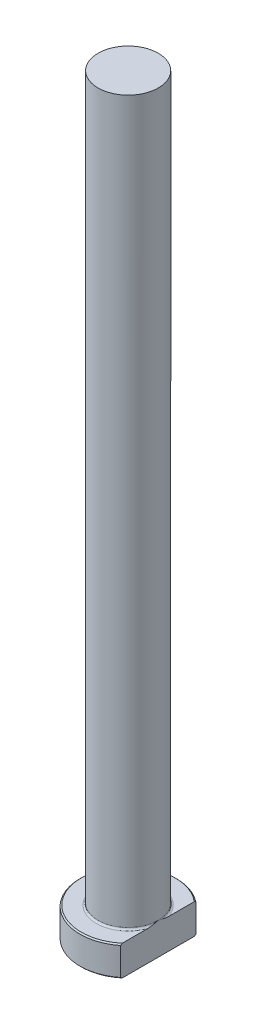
ISO-10303-21;
HEADER;
FILE_DESCRIPTION(('STEP AP214'),'2;1');
FILE_NAME('part.step','',(''),(''),'','','');
FILE_SCHEMA(('AUTOMOTIVE_DESIGN { 1 0 10303 214 1 1 1 1 }'));
ENDSEC;
DATA;
#1=APPLICATION_CONTEXT('core data for automotive mechanical design processes');
#2=APPLICATION_PROTOCOL_DEFINITION('international standard','automotive_design',2000,#1);
#3=PRODUCT_CONTEXT('',#1,'mechanical');
#4=PRODUCT('Part','Part','',(#3));
#5=PRODUCT_RELATED_PRODUCT_CATEGORY('part','',(#4));
#6=PRODUCT_DEFINITION_FORMATION('','',#4);
#7=PRODUCT_DEFINITION_CONTEXT('part definition',#1,'design');
#8=PRODUCT_DEFINITION('design','',#6,#7);
#9=PRODUCT_DEFINITION_SHAPE('','',#8);
#10=(LENGTH_UNIT() NAMED_UNIT(*) SI_UNIT(.MILLI.,.METRE.));
#11=(NAMED_UNIT(*) PLANE_ANGLE_UNIT() SI_UNIT($,.RADIAN.));
#12=(NAMED_UNIT(*) SI_UNIT($,.STERADIAN.) SOLID_ANGLE_UNIT());
#13=UNCERTAINTY_MEASURE_WITH_UNIT(LENGTH_MEASURE(1.E-05),#10,'distance_accuracy_value','');
#14=(GEOMETRIC_REPRESENTATION_CONTEXT(3) GLOBAL_UNCERTAINTY_ASSIGNED_CONTEXT((#13)) GLOBAL_UNIT_ASSIGNED_CONTEXT((#10,
#11,#12)) REPRESENTATION_CONTEXT('',''));
#15=CARTESIAN_POINT('',(0.,0.,0.));
#16=DIRECTION('',(0.,0.,1.));
#17=DIRECTION('',(1.,0.,0.));
#18=AXIS2_PLACEMENT_3D('',#15,#16,#17);
#19=CARTESIAN_POINT('',(0.,0.,0.));
#20=DIRECTION('',(0.,-1.,0.));
#21=DIRECTION('',(0.,0.,-1.));
#22=AXIS2_PLACEMENT_3D('',#19,#20,#21);
#23=PLANE('',#22);
#24=CARTESIAN_POINT('',(0.,0.,0.));
#25=DIRECTION('',(0.,-1.,0.));
#26=DIRECTION('',(0.,0.,-1.));
#27=AXIS2_PLACEMENT_3D('',#24,#25,#26);
#28=CIRCLE('',#27,7.80000000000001);
#29=CARTESIAN_POINT('',(4.99999999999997,0.,5.98665181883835));
#30=VERTEX_POINT('',#29);
#31=CARTESIAN_POINT('',(4.99999999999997,0.,-5.98665181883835));
#32=VERTEX_POINT('',#31);
#33=EDGE_CURVE('E98',#30,#32,#28,.T.);
#34=ORIENTED_EDGE('',*,*,#33,.T.);
#35=DIRECTION('',(0.,0.,1.));
#36=VECTOR('',#35,1.);
#37=CARTESIAN_POINT('',(4.99999999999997,0.,-6.24499799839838));
#38=LINE('',#37,#36);
#39=EDGE_CURVE('E83',#32,#30,#38,.T.);
#40=ORIENTED_EDGE('',*,*,#39,.T.);
#41=EDGE_LOOP('',(#34,#40));
#42=FACE_BOUND('',#41,.T.);
#43=ADVANCED_FACE('F32',(#42),#23,.T.);
#44=CARTESIAN_POINT('',(0.,259.958771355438,0.));
#45=DIRECTION('',(0.,1.,0.));
#46=DIRECTION('',(0.,0.,1.));
#47=AXIS2_PLACEMENT_3D('',#44,#45,#46);
#48=CYLINDRICAL_SURFACE('',#47,7.99999999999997);
#49=CARTESIAN_POINT('',(0.,4.79999999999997,0.));
#50=DIRECTION('',(0.,1.,0.));
#51=DIRECTION('',(0.,0.,1.));
#52=AXIS2_PLACEMENT_3D('',#49,#50,#51);
#53=CIRCLE('',#52,7.99999999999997);
#54=CARTESIAN_POINT('',(4.99999999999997,4.79999999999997,6.24499799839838));
#55=VERTEX_POINT('',#54);
#56=CARTESIAN_POINT('',(4.99999999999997,4.79999999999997,-6.24499799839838));
#57=VERTEX_POINT('',#56);
#58=EDGE_CURVE('E104',#55,#57,#53,.F.);
#59=ORIENTED_EDGE('',*,*,#58,.T.);
#60=DIRECTION('',(0.,-1.,0.));
#61=VECTOR('',#60,1.);
#62=CARTESIAN_POINT('',(4.99999999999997,125.,-6.24499799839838));
#63=LINE('',#62,#61);
#64=CARTESIAN_POINT('',(4.99999999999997,0.199999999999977,-6.24499799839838));
#65=VERTEX_POINT('',#64);
#66=EDGE_CURVE('E183',#57,#65,#63,.T.);
#67=ORIENTED_EDGE('',*,*,#66,.T.);
#68=CARTESIAN_POINT('',(0.,0.199999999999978,0.));
#69=DIRECTION('',(0.,-1.,0.));
#70=DIRECTION('',(0.,0.,-1.));
#71=AXIS2_PLACEMENT_3D('',#68,#69,#70);
#72=CIRCLE('',#71,7.99999999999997);
#73=CARTESIAN_POINT('',(4.99999999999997,0.199999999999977,6.24499799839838));
#74=VERTEX_POINT('',#73);
#75=EDGE_CURVE('E100',#65,#74,#72,.F.);
#76=ORIENTED_EDGE('',*,*,#75,.T.);
#77=DIRECTION('',(0.,-1.,0.));
#78=VECTOR('',#77,1.);
#79=CARTESIAN_POINT('',(4.99999999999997,125.,6.24499799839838));
#80=LINE('',#79,#78);
#81=EDGE_CURVE('E93',#55,#74,#80,.T.);
#82=ORIENTED_EDGE('',*,*,#81,.F.);
#83=EDGE_LOOP('',(#59,#67,#76,#82));
#84=FACE_BOUND('',#83,.T.);
#85=ADVANCED_FACE('F158',(#84),#48,.T.);
#86=CARTESIAN_POINT('',(-7.99999999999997,5.,0.));
#87=DIRECTION('',(0.,1.,0.));
#88=DIRECTION('',(0.,0.,1.));
#89=AXIS2_PLACEMENT_3D('',#86,#87,#88);
#90=PLANE('',#89);
#91=CARTESIAN_POINT('',(0.,5.,0.));
#92=DIRECTION('',(0.,1.,0.));
#93=DIRECTION('',(0.,0.,1.));
#94=AXIS2_PLACEMENT_3D('',#91,#92,#93);
#95=CIRCLE('',#94,7.79999999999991);
#96=CARTESIAN_POINT('',(4.99999999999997,5.,-5.98665181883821));
#97=VERTEX_POINT('',#96);
#98=CARTESIAN_POINT('',(4.99999999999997,5.,5.98665181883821));
#99=VERTEX_POINT('',#98);
#100=EDGE_CURVE('E178',#97,#99,#95,.T.);
#101=ORIENTED_EDGE('',*,*,#100,.T.);
#102=DIRECTION('',(0.,0.,-1.));
#103=VECTOR('',#102,1.);
#104=CARTESIAN_POINT('',(4.99999999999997,5.,0.));
#105=LINE('',#104,#103);
#106=CARTESIAN_POINT('',(4.99999999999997,4.99999999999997,1.75783958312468));
#107=VERTEX_POINT('',#106);
#108=EDGE_CURVE('E57',#99,#107,#105,.T.);
#109=ORIENTED_EDGE('',*,*,#108,.T.);
#110=CARTESIAN_POINT('',(0.,5.,0.));
#111=DIRECTION('',(0.,1.,0.));
#112=DIRECTION('',(0.,0.,1.));
#113=AXIS2_PLACEMENT_3D('',#110,#111,#112);
#114=CIRCLE('',#113,5.29999999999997);
#115=CARTESIAN_POINT('',(4.99999999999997,4.99999999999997,-1.75783958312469));
#116=VERTEX_POINT('',#115);
#117=EDGE_CURVE('E107',#107,#116,#114,.F.);
#118=ORIENTED_EDGE('',*,*,#117,.T.);
#119=EDGE_CURVE('E136',#116,#97,#105,.T.);
#120=ORIENTED_EDGE('',*,*,#119,.T.);
#121=EDGE_LOOP('',(#101,#109,#118,#120));
#122=FACE_BOUND('',#121,.T.);
#123=ADVANCED_FACE('F147',(#122),#90,.T.);
#124=CARTESIAN_POINT('',(0.,5.,0.));
#125=DIRECTION('',(0.,-1.,0.));
#126=DIRECTION('',(0.,0.,-1.));
#127=AXIS2_PLACEMENT_3D('',#124,#125,#126);
#128=CONICAL_SURFACE('',#127,7.7999999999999,0.785398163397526);
#129=ORIENTED_EDGE('',*,*,#58,.F.);
#130=CARTESIAN_POINT('',(4.99999999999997,-1.82162423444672,13.7401563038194));
#131=CARTESIAN_POINT('',(4.99999999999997,-1.61889813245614,13.5244204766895));
#132=CARTESIAN_POINT('',(4.99999999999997,-1.4164638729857,13.3084101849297));
#133=CARTESIAN_POINT('',(4.99999999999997,-1.01227657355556,12.8757508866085));
#134=CARTESIAN_POINT('',(4.99999999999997,-0.810523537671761,12.65910187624));
#135=CARTESIAN_POINT('',(4.99999999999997,-0.206157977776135,12.0077661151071));
#136=CARTESIAN_POINT('',(4.99999999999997,0.195280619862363,11.571988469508));
#137=CARTESIAN_POINT('',(4.99999999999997,1.00388282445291,10.6856136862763));
#138=CARTESIAN_POINT('',(4.99999999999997,1.41093902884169,10.2349182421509));
#139=CARTESIAN_POINT('',(4.99999999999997,2.01658324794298,9.55471676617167));
#140=CARTESIAN_POINT('',(4.99999999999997,2.21758236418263,9.32735800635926));
#141=CARTESIAN_POINT('',(4.99999999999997,2.61761142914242,8.87091599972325));
#142=CARTESIAN_POINT('',(4.99999999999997,2.81664139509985,8.64183276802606));
#143=CARTESIAN_POINT('',(4.99999999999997,3.21217345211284,8.181700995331));
#144=CARTESIAN_POINT('',(4.99999999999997,3.40867681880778,7.95065355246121));
#145=CARTESIAN_POINT('',(4.99999999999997,3.79865427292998,7.48599989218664));
#146=CARTESIAN_POINT('',(4.99999999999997,3.99212827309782,7.2523936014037));
#147=CARTESIAN_POINT('',(4.99999999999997,4.37558160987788,6.78155890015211));
#148=CARTESIAN_POINT('',(4.99999999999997,4.56555334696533,6.54432428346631));
#149=CARTESIAN_POINT('',(4.99999999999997,4.94042138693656,6.06589574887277));
#150=CARTESIAN_POINT('',(4.99999999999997,5.12531810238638,5.82470215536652));
#151=CARTESIAN_POINT('',(4.99999999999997,5.48653546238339,5.33972956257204));
#152=CARTESIAN_POINT('',(4.99999999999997,5.66292392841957,5.09600137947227));
#153=CARTESIAN_POINT('',(4.99999999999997,6.00675382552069,4.60213647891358));
#154=CARTESIAN_POINT('',(4.99999999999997,6.17419169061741,4.35199726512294));
#155=CARTESIAN_POINT('',(4.99999999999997,6.49592993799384,3.84445040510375));
#156=CARTESIAN_POINT('',(4.99999999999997,6.65027272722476,3.58707012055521));
#157=CARTESIAN_POINT('',(4.99999999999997,6.86813414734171,3.19356592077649));
#158=CARTESIAN_POINT('',(4.99999999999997,6.93845533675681,3.06120993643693));
#159=CARTESIAN_POINT('',(4.99999999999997,7.0736044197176,2.79373319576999));
#160=CARTESIAN_POINT('',(4.99999999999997,7.13843319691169,2.65861288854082));
#161=CARTESIAN_POINT('',(4.99999999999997,7.2686964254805,2.36936389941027));
#162=CARTESIAN_POINT('',(4.99999999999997,7.33331212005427,2.21486278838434));
#163=CARTESIAN_POINT('',(4.99999999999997,7.45243473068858,1.90194073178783));
#164=CARTESIAN_POINT('',(4.99999999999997,7.50694001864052,1.7435191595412));
#165=CARTESIAN_POINT('',(4.99999999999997,7.60343746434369,1.42384276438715));
#166=CARTESIAN_POINT('',(4.99999999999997,7.64549910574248,1.26260921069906));
#167=CARTESIAN_POINT('',(4.99999999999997,7.7154308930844,0.937062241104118));
#168=CARTESIAN_POINT('',(4.99999999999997,7.74330266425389,0.772749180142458));
#169=CARTESIAN_POINT('',(4.99999999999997,7.78344284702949,0.439876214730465));
#170=CARTESIAN_POINT('',(4.99999999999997,7.79548961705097,0.271289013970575));
#171=CARTESIAN_POINT('',(4.99999999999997,7.8024080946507,-0.0662275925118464));
#172=CARTESIAN_POINT('',(4.99999999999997,7.79728142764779,-0.235156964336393));
#173=CARTESIAN_POINT('',(4.99999999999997,7.77017954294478,-0.572209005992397));
#174=CARTESIAN_POINT('',(4.99999999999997,7.74814735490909,-0.7403270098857));
#175=CARTESIAN_POINT('',(4.99999999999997,7.68863212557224,-1.07379849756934));
#176=CARTESIAN_POINT('',(4.99999999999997,7.65114437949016,-1.2391511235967));
#177=CARTESIAN_POINT('',(4.99999999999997,7.54734433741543,-1.62344926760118));
#178=CARTESIAN_POINT('',(4.99999999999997,7.47553580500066,-1.84089917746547));
#179=CARTESIAN_POINT('',(4.99999999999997,7.31300119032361,-2.26856946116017));
#180=CARTESIAN_POINT('',(4.99999999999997,7.22226460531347,-2.47878574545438));
#181=CARTESIAN_POINT('',(4.99999999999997,7.07492970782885,-2.79014067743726));
#182=CARTESIAN_POINT('',(4.99999999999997,7.02362278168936,-2.89384077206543));
#183=CARTESIAN_POINT('',(4.99999999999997,6.91783840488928,-3.0996162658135));
#184=CARTESIAN_POINT('',(4.99999999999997,6.86336091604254,-3.20169164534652));
#185=CARTESIAN_POINT('',(4.99999999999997,6.75169048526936,-3.40428995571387));
#186=CARTESIAN_POINT('',(4.99999999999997,6.69449856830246,-3.50481345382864));
#187=CARTESIAN_POINT('',(4.99999999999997,6.57774196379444,-3.70446206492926));
#188=CARTESIAN_POINT('',(4.99999999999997,6.51817739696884,-3.80358724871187));
#189=CARTESIAN_POINT('',(4.99999999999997,6.3085365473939,-4.1443576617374));
#190=CARTESIAN_POINT('',(4.99999999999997,6.15326588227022,-4.38281352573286));
#191=CARTESIAN_POINT('',(4.99999999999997,5.83377190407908,-4.85367607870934));
#192=CARTESIAN_POINT('',(4.99999999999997,5.66954595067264,-5.08608095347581));
#193=CARTESIAN_POINT('',(4.99999999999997,5.33431698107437,-5.54628554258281));
#194=CARTESIAN_POINT('',(4.99999999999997,5.1633074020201,-5.77408045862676));
#195=CARTESIAN_POINT('',(4.99999999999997,4.81629923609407,-6.22578157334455));
#196=CARTESIAN_POINT('',(4.99999999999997,4.64030119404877,-6.44968819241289));
#197=CARTESIAN_POINT('',(4.99999999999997,4.283686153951,-6.89532578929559));
#198=CARTESIAN_POINT('',(4.99999999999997,4.1030528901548,-7.11704371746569));
#199=CARTESIAN_POINT('',(4.99999999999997,3.73870710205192,-7.55793799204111));
#200=CARTESIAN_POINT('',(4.99999999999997,3.55499450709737,-7.7771142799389));
#201=CARTESIAN_POINT('',(4.99999999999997,3.18521083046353,-8.21325328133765));
#202=CARTESIAN_POINT('',(4.99999999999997,2.9991411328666,-8.4302171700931));
#203=CARTESIAN_POINT('',(4.99999999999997,2.6249981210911,-8.86241167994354));
#204=CARTESIAN_POINT('',(4.99999999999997,2.43692478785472,-9.07764228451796));
#205=CARTESIAN_POINT('',(4.99999999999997,1.91463404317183,-9.67075518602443));
#206=CARTESIAN_POINT('',(4.99999999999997,1.57868086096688,-10.0471086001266));
#207=CARTESIAN_POINT('',(4.99999999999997,0.903003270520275,-10.7965122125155));
#208=CARTESIAN_POINT('',(4.99999999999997,0.563278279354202,-11.1695618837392));
#209=CARTESIAN_POINT('',(4.99999999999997,-0.116149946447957,-11.9100168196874));
#210=CARTESIAN_POINT('',(4.99999999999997,-0.4558301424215,-12.2774432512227));
#211=CARTESIAN_POINT('',(4.99999999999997,-1.13728640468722,-13.0102135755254));
#212=CARTESIAN_POINT('',(4.99999999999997,-1.47906204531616,-13.3755578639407));
#213=CARTESIAN_POINT('',(4.99999999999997,-1.82162423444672,-13.7401563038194));
#214=B_SPLINE_CURVE_WITH_KNOTS('',3,(#130,#131,#132,#133,#134,#135,#136,#137,#138,#139,#140,
#141,#142,#143,#144,#145,#146,#147,#148,#149,#150,#151,#152,#153,#154,#155,#156,#157,#158,#159,
#160,#161,#162,#163,#164,#165,#166,#167,#168,#169,#170,#171,#172,#173,#174,#175,#176,#177,#178,
#179,#180,#181,#182,#183,#184,#185,#186,#187,#188,#189,#190,#191,#192,#193,#194,#195,#196,#197,
#198,#199,#200,#201,#202,#203,#204,#205,#206,#207,#208,#209,#210,#211,#212,#213),.UNSPECIFIED.,
.F.,.F.,(4,2,2,2,2,2,2,2,2,2,2,2,2,2,2,2,2,2,2,2,2,2,2,2,2,2,2,2,2,2,2,2,2,2,2,2,2,2,2,2,2,4),
(0.,0.888120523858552,1.77624635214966,3.55372511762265,5.37559481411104,6.28598924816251,
7.19637570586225,8.10628289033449,9.01621623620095,9.92793449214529,10.8395784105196,
11.7420025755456,12.6447836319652,13.5445196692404,13.9940505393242,14.4435089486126,
14.9456212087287,15.4478142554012,15.947147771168,16.4464240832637,16.9526211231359,
17.4587702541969,17.966632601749,18.4746496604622,19.1604516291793,19.8466351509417,
20.1936870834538,20.540743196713,20.8876692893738,21.2345777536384,22.087909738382,
22.9414946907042,23.7959266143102,24.6502655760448,25.5081848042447,26.366123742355,
27.223580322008,28.0810450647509,29.5944656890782,31.1081235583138,32.6092678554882,
34.1101167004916),.UNSPECIFIED.);
#215=EDGE_CURVE('E135',#55,#99,#214,.T.);
#216=ORIENTED_EDGE('',*,*,#215,.T.);
#217=ORIENTED_EDGE('',*,*,#100,.F.);
#218=EDGE_CURVE('E127',#97,#57,#214,.T.);
#219=ORIENTED_EDGE('',*,*,#218,.T.);
#220=EDGE_LOOP('',(#129,#216,#217,#219));
#221=FACE_BOUND('',#220,.T.);
#222=ADVANCED_FACE('F143',(#221),#128,.T.);
#223=CARTESIAN_POINT('',(0.,0.199999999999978,0.));
#224=DIRECTION('',(0.,1.,0.));
#225=DIRECTION('',(0.,0.,1.));
#226=AXIS2_PLACEMENT_3D('',#223,#224,#225);
#227=CONICAL_SURFACE('',#226,7.99999999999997,0.785398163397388);
#228=ORIENTED_EDGE('',*,*,#75,.F.);
#229=CARTESIAN_POINT('',(4.99999999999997,6.82162423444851,-13.7401563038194));
#230=CARTESIAN_POINT('',(4.99999999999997,6.61889813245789,-13.5244204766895));
#231=CARTESIAN_POINT('',(4.99999999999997,6.41646387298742,-13.3084101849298));
#232=CARTESIAN_POINT('',(4.99999999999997,6.01227657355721,-12.8757508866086));
#233=CARTESIAN_POINT('',(4.99999999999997,5.81052353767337,-12.6591018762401));
#234=CARTESIAN_POINT('',(4.99999999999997,5.20615797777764,-12.0077661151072));
#235=CARTESIAN_POINT('',(4.99999999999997,4.80471938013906,-11.5719884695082));
#236=CARTESIAN_POINT('',(4.99999999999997,3.99611717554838,-10.6856136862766));
#237=CARTESIAN_POINT('',(4.99999999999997,3.58906097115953,-10.2349182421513));
#238=CARTESIAN_POINT('',(4.99999999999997,2.98341675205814,-9.55471676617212));
#239=CARTESIAN_POINT('',(4.99999999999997,2.78241763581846,-9.32735800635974));
#240=CARTESIAN_POINT('',(4.99999999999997,2.3823885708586,-8.87091599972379));
#241=CARTESIAN_POINT('',(4.99999999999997,2.18335860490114,-8.64183276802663));
#242=CARTESIAN_POINT('',(4.99999999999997,1.78782654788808,-8.18170099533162));
#243=CARTESIAN_POINT('',(4.99999999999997,1.5913231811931,-7.95065355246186));
#244=CARTESIAN_POINT('',(4.99999999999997,1.20134572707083,-7.48599989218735));
#245=CARTESIAN_POINT('',(4.99999999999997,1.00787172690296,-7.25239360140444));
#246=CARTESIAN_POINT('',(4.99999999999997,0.624418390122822,-6.78155890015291));
#247=CARTESIAN_POINT('',(4.99999999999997,0.434446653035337,-6.54432428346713));
#248=CARTESIAN_POINT('',(4.99999999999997,0.0595786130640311,-6.06589574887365));
#249=CARTESIAN_POINT('',(4.99999999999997,-0.125318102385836,-5.82470215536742));
#250=CARTESIAN_POINT('',(4.99999999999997,-0.486535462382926,-5.33972956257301));
#251=CARTESIAN_POINT('',(4.99999999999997,-0.662923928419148,-5.09600137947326));
#252=CARTESIAN_POINT('',(4.99999999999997,-1.00675382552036,-4.60213647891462));
#253=CARTESIAN_POINT('',(4.99999999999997,-1.17419169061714,-4.35199726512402));
#254=CARTESIAN_POINT('',(4.99999999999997,-1.49592993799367,-3.84445040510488));
#255=CARTESIAN_POINT('',(4.99999999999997,-1.65027272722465,-3.58707012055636));
#256=CARTESIAN_POINT('',(4.99999999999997,-1.86813414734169,-3.19356592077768));
#257=CARTESIAN_POINT('',(4.99999999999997,-1.93845533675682,-3.06120993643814));
#258=CARTESIAN_POINT('',(4.99999999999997,-2.07360441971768,-2.79373319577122));
#259=CARTESIAN_POINT('',(4.99999999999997,-2.1384331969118,-2.65861288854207));
#260=CARTESIAN_POINT('',(4.99999999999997,-2.26869642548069,-2.36936389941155));
#261=CARTESIAN_POINT('',(4.99999999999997,-2.3333121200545,-2.21486278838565));
#262=CARTESIAN_POINT('',(4.99999999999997,-2.45243473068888,-1.90194073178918));
#263=CARTESIAN_POINT('',(4.99999999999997,-2.50694001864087,-1.74351915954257));
#264=CARTESIAN_POINT('',(4.99999999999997,-2.60343746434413,-1.42384276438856));
#265=CARTESIAN_POINT('',(4.99999999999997,-2.64549910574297,-1.26260921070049));
#266=CARTESIAN_POINT('',(4.99999999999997,-2.71543089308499,-0.937062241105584));
#267=CARTESIAN_POINT('',(4.99999999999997,-2.74330266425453,-0.772749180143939));
#268=CARTESIAN_POINT('',(4.99999999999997,-2.78344284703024,-0.439876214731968));
#269=CARTESIAN_POINT('',(4.99999999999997,-2.79548961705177,-0.271289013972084));
#270=CARTESIAN_POINT('',(4.99999999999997,-2.80240809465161,0.0662275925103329));
#271=CARTESIAN_POINT('',(4.99999999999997,-2.79728142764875,0.23515696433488));
#272=CARTESIAN_POINT('',(4.99999999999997,-2.77017954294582,0.572209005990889));
#273=CARTESIAN_POINT('',(4.99999999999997,-2.74814735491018,0.740327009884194));
#274=CARTESIAN_POINT('',(4.99999999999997,-2.6886321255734,1.07379849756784));
#275=CARTESIAN_POINT('',(4.99999999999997,-2.65114437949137,1.23915112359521));
#276=CARTESIAN_POINT('',(4.99999999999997,-2.54734433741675,1.62344926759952));
#277=CARTESIAN_POINT('',(4.99999999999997,-2.47553580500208,1.84089917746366));
#278=CARTESIAN_POINT('',(4.99999999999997,-2.31300119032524,2.26856946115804));
#279=CARTESIAN_POINT('',(4.99999999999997,-2.2222646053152,2.47878574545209));
#280=CARTESIAN_POINT('',(4.99999999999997,-2.07492970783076,2.79014067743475));
#281=CARTESIAN_POINT('',(4.99999999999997,-2.02362278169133,2.89384077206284));
#282=CARTESIAN_POINT('',(4.99999999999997,-1.91783840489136,3.09961626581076));
#283=CARTESIAN_POINT('',(4.99999999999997,-1.86336091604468,3.20169164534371));
#284=CARTESIAN_POINT('',(4.99999999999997,-1.75169048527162,3.40428995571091));
#285=CARTESIAN_POINT('',(4.99999999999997,-1.69449856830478,3.50481345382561));
#286=CARTESIAN_POINT('',(4.99999999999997,-1.57774196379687,3.70446206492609));
#287=CARTESIAN_POINT('',(4.99999999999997,-1.51817739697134,3.80358724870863));
#288=CARTESIAN_POINT('',(4.99999999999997,-1.3085365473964,4.14435766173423));
#289=CARTESIAN_POINT('',(4.99999999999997,-1.15326588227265,4.38281352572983));
#290=CARTESIAN_POINT('',(4.99999999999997,-0.833771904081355,4.85367607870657));
#291=CARTESIAN_POINT('',(4.99999999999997,-0.669545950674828,5.08608095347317));
#292=CARTESIAN_POINT('',(4.99999999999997,-0.334316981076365,5.5462855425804));
#293=CARTESIAN_POINT('',(4.99999999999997,-0.163307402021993,5.77408045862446));
#294=CARTESIAN_POINT('',(4.99999999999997,0.183700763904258,6.22578157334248));
#295=CARTESIAN_POINT('',(4.99999999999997,0.359698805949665,6.44968819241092));
#296=CARTESIAN_POINT('',(4.99999999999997,0.716313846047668,6.89532578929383));
#297=CARTESIAN_POINT('',(4.99999999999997,0.896947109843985,7.11704371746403));
#298=CARTESIAN_POINT('',(4.99999999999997,1.26129289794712,7.55793799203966));
#299=CARTESIAN_POINT('',(4.99999999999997,1.44500549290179,7.77711427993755));
#300=CARTESIAN_POINT('',(4.99999999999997,1.81478916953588,8.2132532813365));
#301=CARTESIAN_POINT('',(4.99999999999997,2.00085886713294,8.43021717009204));
#302=CARTESIAN_POINT('',(4.99999999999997,2.37500187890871,8.86241167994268));
#303=CARTESIAN_POINT('',(4.99999999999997,2.56307521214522,9.0776422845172));
#304=CARTESIAN_POINT('',(4.99999999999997,3.08536595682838,9.67075518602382));
#305=CARTESIAN_POINT('',(4.99999999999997,3.42131913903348,10.0471086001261));
#306=CARTESIAN_POINT('',(4.99999999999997,4.09699672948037,10.7965122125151));
#307=CARTESIAN_POINT('',(4.99999999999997,4.43672172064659,11.1695618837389));
#308=CARTESIAN_POINT('',(4.99999999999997,5.11614994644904,11.9100168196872));
#309=CARTESIAN_POINT('',(4.99999999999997,5.45583014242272,12.2774432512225));
#310=CARTESIAN_POINT('',(4.99999999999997,6.13728640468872,13.0102135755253));
#311=CARTESIAN_POINT('',(4.99999999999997,6.4790620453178,13.3755578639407));
#312=CARTESIAN_POINT('',(4.99999999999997,6.82162423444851,13.7401563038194));
#313=B_SPLINE_CURVE_WITH_KNOTS('',3,(#229,#230,#231,#232,#233,#234,#235,#236,#237,#238,#239,
#240,#241,#242,#243,#244,#245,#246,#247,#248,#249,#250,#251,#252,#253,#254,#255,#256,#257,#258,
#259,#260,#261,#262,#263,#264,#265,#266,#267,#268,#269,#270,#271,#272,#273,#274,#275,#276,#277,
#278,#279,#280,#281,#282,#283,#284,#285,#286,#287,#288,#289,#290,#291,#292,#293,#294,#295,#296,
#297,#298,#299,#300,#301,#302,#303,#304,#305,#306,#307,#308,#309,#310,#311,#312),.UNSPECIFIED.,
.F.,.F.,(4,2,2,2,2,2,2,2,2,2,2,2,2,2,2,2,2,2,2,2,2,2,2,2,2,2,2,2,2,2,2,2,2,2,2,2,2,2,2,2,2,4),
(0.,0.888120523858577,1.77624635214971,3.55372511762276,5.37559481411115,6.28598924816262,
7.19637570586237,8.10628289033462,9.01621623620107,9.92793449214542,10.8395784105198,
11.7420025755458,12.6447836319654,13.5445196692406,13.9940505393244,14.4435089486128,
14.9456212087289,15.4478142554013,15.9471477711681,16.4464240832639,16.952621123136,
17.458770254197,17.9666326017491,18.4746496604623,19.1604516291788,19.8466351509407,
20.1936870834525,20.5407431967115,20.8876692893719,21.2345777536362,22.0879097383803,
22.941494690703,23.7959266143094,24.6502655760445,25.5081848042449,26.3661237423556,
27.2235803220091,28.0810450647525,29.5944656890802,31.1081235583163,32.609267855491,
34.1101167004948),.UNSPECIFIED.);
#314=EDGE_CURVE('E86',#65,#32,#313,.T.);
#315=ORIENTED_EDGE('',*,*,#314,.T.);
#316=ORIENTED_EDGE('',*,*,#33,.F.);
#317=EDGE_CURVE('E89',#30,#74,#313,.T.);
#318=ORIENTED_EDGE('',*,*,#317,.T.);
#319=EDGE_LOOP('',(#228,#315,#316,#318));
#320=FACE_BOUND('',#319,.T.);
#321=ADVANCED_FACE('F97',(#320),#227,.T.);
#322=CARTESIAN_POINT('',(0.,5.29999999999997,0.));
#323=DIRECTION('',(0.,1.,0.));
#324=DIRECTION('',(0.,0.,1.));
#325=AXIS2_PLACEMENT_3D('',#322,#323,#324);
#326=TOROIDAL_SURFACE('',#325,5.29999999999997,0.3);
#327=CARTESIAN_POINT('',(4.99999999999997,5.29999999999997,0.));
#328=CARTESIAN_POINT('',(4.99999999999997,5.30000062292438,1.31470000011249E-10));
#329=CARTESIAN_POINT('',(4.99999999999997,5.30000124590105,-2.52759208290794E-07));
#330=CARTESIAN_POINT('',(4.99999999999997,5.30000240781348,-9.4716432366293E-07));
#331=CARTESIAN_POINT('',(4.99999999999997,5.30000293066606,-1.40594035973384E-06));
#332=CARTESIAN_POINT('',(4.99999999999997,5.30000402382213,-2.50637603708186E-06));
#333=CARTESIAN_POINT('',(4.99999999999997,5.30000457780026,-3.16588904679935E-06));
#334=CARTESIAN_POINT('',(4.99999999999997,5.30000556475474,-4.52859961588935E-06));
#335=CARTESIAN_POINT('',(4.99999999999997,5.30000600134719,-5.22939444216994E-06));
#336=CARTESIAN_POINT('',(4.99999999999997,5.30000763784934,-7.96121978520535E-06));
#337=CARTESIAN_POINT('',(4.99999999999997,5.30000875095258,-1.0047740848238E-05));
#338=CARTESIAN_POINT('',(4.99999999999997,5.30001056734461,-1.41660873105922E-05));
#339=CARTESIAN_POINT('',(4.99999999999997,5.30001129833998,-1.61861783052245E-05));
#340=CARTESIAN_POINT('',(4.99999999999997,5.30001439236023,-2.47865739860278E-05));
#341=CARTESIAN_POINT('',(4.99999999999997,5.30001672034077,-3.1383028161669E-05));
#342=CARTESIAN_POINT('',(4.99999999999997,5.30002012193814,-4.38084218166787E-05));
#343=CARTESIAN_POINT('',(4.99999999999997,5.30002133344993,-4.95992736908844E-05));
#344=CARTESIAN_POINT('',(4.99999999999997,5.30003020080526,-9.27862610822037E-05));
#345=CARTESIAN_POINT('',(4.99999999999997,5.30003696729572,-0.000130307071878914));
#346=CARTESIAN_POINT('',(4.99999999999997,5.30006659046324,-0.000278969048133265));
#347=CARTESIAN_POINT('',(4.99999999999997,5.30009481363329,-0.000389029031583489));
#348=CARTESIAN_POINT('',(4.99999999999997,5.3002050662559,-0.000826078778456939));
#349=CARTESIAN_POINT('',(4.99999999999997,5.30028365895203,-0.0011536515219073));
#350=CARTESIAN_POINT('',(4.99999999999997,5.300599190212,-0.0024592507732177));
#351=CARTESIAN_POINT('',(4.99999999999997,5.30084048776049,-0.00343651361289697));
#352=CARTESIAN_POINT('',(4.99999999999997,5.3018462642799,-0.00752058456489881));
#353=CARTESIAN_POINT('',(4.99999999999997,5.3026052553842,-0.0106283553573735));
#354=CARTESIAN_POINT('',(4.99999999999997,5.30996461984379,-0.0407482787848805));
#355=CARTESIAN_POINT('',(4.99999999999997,5.31658985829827,-0.0677561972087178));
#356=CARTESIAN_POINT('',(4.99999999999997,5.32953319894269,-0.120688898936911));
#357=CARTESIAN_POINT('',(4.99999999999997,5.33585289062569,-0.146613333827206));
#358=CARTESIAN_POINT('',(4.99999999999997,5.34926050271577,-0.201795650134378));
#359=CARTESIAN_POINT('',(4.99999999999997,5.35634306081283,-0.231054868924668));
#360=CARTESIAN_POINT('',(4.99999999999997,5.37050252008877,-0.289917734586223));
#361=CARTESIAN_POINT('',(4.99999999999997,5.37757848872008,-0.319521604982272));
#362=CARTESIAN_POINT('',(4.99999999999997,5.39452602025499,-0.391032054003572));
#363=CARTESIAN_POINT('',(4.99999999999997,5.40434071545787,-0.432952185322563));
#364=CARTESIAN_POINT('',(4.99999999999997,5.42340141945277,-0.51576321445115));
#365=CARTESIAN_POINT('',(4.99999999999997,5.43265559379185,-0.556652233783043));
#366=CARTESIAN_POINT('',(4.99999999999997,5.45710553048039,-0.667075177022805));
#367=CARTESIAN_POINT('',(4.99999999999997,5.47194176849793,-0.736689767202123));
#368=CARTESIAN_POINT('',(4.99999999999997,5.50018229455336,-0.876836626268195));
#369=CARTESIAN_POINT('',(4.99999999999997,5.51357312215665,-0.947371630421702));
#370=CARTESIAN_POINT('',(4.99999999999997,5.53930921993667,-1.09497328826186));
#371=CARTESIAN_POINT('',(4.99999999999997,5.55146217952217,-1.17207432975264));
#372=CARTESIAN_POINT('',(4.99999999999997,5.57239669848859,-1.32672649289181));
#373=CARTESIAN_POINT('',(4.99999999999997,5.58117877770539,-1.40427754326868));
#374=CARTESIAN_POINT('',(4.99999999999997,5.594997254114,-1.5687382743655));
#375=CARTESIAN_POINT('',(4.99999999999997,5.59948802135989,-1.65570044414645));
#376=CARTESIAN_POINT('',(4.99999999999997,5.60018885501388,-1.78535304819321));
#377=CARTESIAN_POINT('',(4.99999999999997,5.59945214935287,-1.82802575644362));
#378=CARTESIAN_POINT('',(4.99999999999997,5.59559364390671,-1.91325081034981));
#379=CARTESIAN_POINT('',(4.99999999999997,5.59247319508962,-1.95580321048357));
#380=CARTESIAN_POINT('',(4.99999999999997,5.5838324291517,-2.03512365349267));
#381=CARTESIAN_POINT('',(4.99999999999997,5.57867386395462,-2.07192937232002));
#382=CARTESIAN_POINT('',(4.99999999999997,5.56543793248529,-2.1452675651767));
#383=CARTESIAN_POINT('',(4.99999999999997,5.55734203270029,-2.18179676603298));
#384=CARTESIAN_POINT('',(4.99999999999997,5.53718005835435,-2.25427226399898));
#385=CARTESIAN_POINT('',(4.99999999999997,5.52507057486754,-2.29020746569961));
#386=CARTESIAN_POINT('',(4.99999999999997,5.50270928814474,-2.34223029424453));
#387=CARTESIAN_POINT('',(4.99999999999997,5.4945781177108,-2.35922314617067));
#388=CARTESIAN_POINT('',(4.99999999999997,5.47657809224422,-2.39224900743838));
#389=CARTESIAN_POINT('',(4.99999999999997,5.46671281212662,-2.40828390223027));
#390=CARTESIAN_POINT('',(4.99999999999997,5.44695893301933,-2.43579467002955));
#391=CARTESIAN_POINT('',(4.99999999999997,5.4374587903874,-2.44754592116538));
#392=CARTESIAN_POINT('',(4.99999999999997,5.41677914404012,-2.46946476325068));
#393=CARTESIAN_POINT('',(4.99999999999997,5.40560543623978,-2.47963758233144));
#394=CARTESIAN_POINT('',(4.99999999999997,5.38617750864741,-2.49393642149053));
#395=CARTESIAN_POINT('',(4.99999999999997,5.37851643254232,-2.49886271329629));
#396=CARTESIAN_POINT('',(4.99999999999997,5.36252740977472,-2.50749953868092));
#397=CARTESIAN_POINT('',(4.99999999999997,5.35419984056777,-2.51121075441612));
#398=CARTESIAN_POINT('',(4.99999999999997,5.33690648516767,-2.51712941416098));
#399=CARTESIAN_POINT('',(4.99999999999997,5.3279345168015,-2.51931927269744));
#400=CARTESIAN_POINT('',(4.99999999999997,5.30973576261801,-2.52185978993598));
#401=CARTESIAN_POINT('',(4.99999999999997,5.30050931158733,-2.52221275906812));
#402=CARTESIAN_POINT('',(4.99999999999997,5.28349166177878,-2.52112455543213));
#403=CARTESIAN_POINT('',(4.99999999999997,5.27568322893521,-2.519931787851));
#404=CARTESIAN_POINT('',(4.99999999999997,5.26036860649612,-2.51628294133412));
#405=CARTESIAN_POINT('',(4.99999999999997,5.25286261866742,-2.51382603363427));
#406=CARTESIAN_POINT('',(4.99999999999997,5.23590266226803,-2.50685484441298));
#407=CARTESIAN_POINT('',(4.99999999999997,5.22661875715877,-2.50192984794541));
#408=CARTESIAN_POINT('',(4.99999999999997,5.20895514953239,-2.49066548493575));
#409=CARTESIAN_POINT('',(4.99999999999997,5.20057756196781,-2.48432291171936));
#410=CARTESIAN_POINT('',(4.99999999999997,5.1798700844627,-2.46645212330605));
#411=CARTESIAN_POINT('',(4.99999999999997,5.1682415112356,-2.45411867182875));
#412=CARTESIAN_POINT('',(4.99999999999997,5.14692461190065,-2.42790849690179));
#413=CARTESIAN_POINT('',(4.99999999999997,5.13723987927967,-2.41402898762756));
#414=CARTESIAN_POINT('',(4.99999999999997,5.11080706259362,-2.37143175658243));
#415=CARTESIAN_POINT('',(4.99999999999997,5.09628770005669,-2.34134703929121));
#416=CARTESIAN_POINT('',(4.99999999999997,5.07130349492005,-2.27940731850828));
#417=CARTESIAN_POINT('',(4.99999999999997,5.06087110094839,-2.24754035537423));
#418=CARTESIAN_POINT('',(4.99999999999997,5.03890359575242,-2.16787245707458));
#419=CARTESIAN_POINT('',(4.99999999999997,5.02913523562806,-2.1195906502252));
#420=CARTESIAN_POINT('',(4.99999999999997,5.01416953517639,-2.02224928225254));
#421=CARTESIAN_POINT('',(4.99999999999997,5.00898637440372,-1.97318778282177));
#422=CARTESIAN_POINT('',(4.99999999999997,5.00220823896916,-1.87635767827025));
#423=CARTESIAN_POINT('',(4.99999999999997,5.00050709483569,-1.82859609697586));
#424=CARTESIAN_POINT('',(4.99999999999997,4.99969104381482,-1.73330165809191));
#425=CARTESIAN_POINT('',(4.99999999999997,5.00056327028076,-1.68576884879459));
#426=CARTESIAN_POINT('',(4.99999999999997,5.0048429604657,-1.57937770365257));
#427=CARTESIAN_POINT('',(4.99999999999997,5.00880932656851,-1.52054285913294));
#428=CARTESIAN_POINT('',(4.99999999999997,5.01925964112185,-1.40312974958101));
#429=CARTESIAN_POINT('',(4.99999999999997,5.02574264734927,-1.34455139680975));
#430=CARTESIAN_POINT('',(4.99999999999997,5.04090087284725,-1.22627662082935));
#431=CARTESIAN_POINT('',(4.99999999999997,5.0496242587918,-1.16658647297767));
#432=CARTESIAN_POINT('',(4.99999999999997,5.06877923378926,-1.04732463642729));
#433=CARTESIAN_POINT('',(4.99999999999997,5.07921523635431,-0.987753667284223));
#434=CARTESIAN_POINT('',(4.99999999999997,5.10551698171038,-0.846936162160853));
#435=CARTESIAN_POINT('',(4.99999999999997,5.12196565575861,-0.765799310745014));
#436=CARTESIAN_POINT('',(4.99999999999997,5.15639716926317,-0.604819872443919));
#437=CARTESIAN_POINT('',(4.99999999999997,5.17436050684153,-0.524973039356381));
#438=CARTESIAN_POINT('',(4.99999999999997,5.20921667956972,-0.374726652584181));
#439=CARTESIAN_POINT('',(4.99999999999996,5.22599388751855,-0.304300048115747));
#440=CARTESIAN_POINT('',(4.99999999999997,5.2519110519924,-0.196907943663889));
#441=CARTESIAN_POINT('',(4.99999999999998,5.26090146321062,-0.159905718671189));
#442=CARTESIAN_POINT('',(4.99999999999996,5.27881854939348,-0.0865164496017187));
#443=CARTESIAN_POINT('',(4.99999999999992,5.28774391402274,-0.0501291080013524));
#444=CARTESIAN_POINT('',(4.99999999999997,5.29739627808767,-0.0106218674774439));
#445=CARTESIAN_POINT('',(4.99999999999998,5.2981568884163,-0.00750762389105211));
#446=CARTESIAN_POINT('',(4.99999999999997,5.2991630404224,-0.00342209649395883));
#447=CARTESIAN_POINT('',(4.99999999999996,5.29940309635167,-0.00244985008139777));
#448=CARTESIAN_POINT('',(4.99999999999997,5.29971711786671,-0.00115049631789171));
#449=CARTESIAN_POINT('',(4.99999999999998,5.299795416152,-0.000824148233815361));
#450=CARTESIAN_POINT('',(4.99999999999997,5.2999053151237,-0.000388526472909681));
#451=CARTESIAN_POINT('',(4.99999999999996,5.29993348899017,-0.0002786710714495));
#452=CARTESIAN_POINT('',(4.99999999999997,5.29996306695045,-0.000130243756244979));
#453=CARTESIAN_POINT('',(4.99999999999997,5.29996982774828,-9.2751137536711E-05));
#454=CARTESIAN_POINT('',(4.99999999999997,5.29997868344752,-4.95929887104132E-05));
#455=CARTESIAN_POINT('',(4.99999999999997,5.29997989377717,-4.38036553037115E-05));
#456=CARTESIAN_POINT('',(4.99999999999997,5.29998329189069,-3.13814183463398E-05));
#457=CARTESIAN_POINT('',(4.99999999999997,5.29998561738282,-2.4786521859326E-05));
#458=CARTESIAN_POINT('',(4.99999999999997,5.29998870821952,-1.61877546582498E-05));
#459=CARTESIAN_POINT('',(4.99999999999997,5.29998943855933,-1.41677768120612E-05));
#460=CARTESIAN_POINT('',(4.99999999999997,5.29999125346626,-1.00495530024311E-05));
#461=CARTESIAN_POINT('',(4.99999999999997,5.29999236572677,-7.96302653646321E-06));
#462=CARTESIAN_POINT('',(4.99999999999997,5.29999400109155,-5.23107415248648E-06));
#463=CARTESIAN_POINT('',(4.99999999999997,5.29999443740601,-4.53021031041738E-06));
#464=CARTESIAN_POINT('',(4.99999999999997,5.29999542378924,-3.16731152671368E-06));
#465=CARTESIAN_POINT('',(4.99999999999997,5.29999597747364,-2.50767725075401E-06));
#466=CARTESIAN_POINT('',(4.99999999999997,5.29999707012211,-1.40695877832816E-06));
#467=CARTESIAN_POINT('',(4.99999999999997,5.29999759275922,-9.48032431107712E-07));
#468=CARTESIAN_POINT('',(4.99999999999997,5.29999875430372,-2.53244317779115E-07));
#469=CARTESIAN_POINT('',(4.99999999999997,5.29999937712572,-1.3145941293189E-10));
#470=CARTESIAN_POINT('',(4.99999999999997,5.29999999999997,0.));
#471=B_SPLINE_CURVE_WITH_KNOTS('',3,(#327,#328,#329,#330,#331,#332,#333,#334,#335,#336,#337,
#338,#339,#340,#341,#342,#343,#344,#345,#346,#347,#348,#349,#350,#351,#352,#353,#354,#355,#356,
#357,#358,#359,#360,#361,#362,#363,#364,#365,#366,#367,#368,#369,#370,#371,#372,#373,#374,#375,
#376,#377,#378,#379,#380,#381,#382,#383,#384,#385,#386,#387,#388,#389,#390,#391,#392,#393,#394,
#395,#396,#397,#398,#399,#400,#401,#402,#403,#404,#405,#406,#407,#408,#409,#410,#411,#412,#413,
#414,#415,#416,#417,#418,#419,#420,#421,#422,#423,#424,#425,#426,#427,#428,#429,#430,#431,#432,
#433,#434,#435,#436,#437,#438,#439,#440,#441,#442,#443,#444,#445,#446,#447,#448,#449,#450,#451,
#452,#453,#454,#455,#456,#457,#458,#459,#460,#461,#462,#463,#464,#465,#466,#467,#468,#469,#470),
.UNSPECIFIED.,.T.,.F.,(4,2,2,2,2,2,2,2,2,2,2,2,2,2,2,2,2,2,2,2,2,2,2,2,2,2,2,2,2,2,2,2,2,2,2,2,
2,2,2,2,2,2,2,2,2,2,2,2,2,2,2,2,2,2,2,2,2,2,2,2,2,2,2,2,2,2,2,2,2,2,2,4),(0.,
1.88939317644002E-06,3.98058917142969E-06,6.54818564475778E-06,9.0240439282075E-06,
1.60938750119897E-05,2.25328198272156E-05,4.34843921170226E-05,6.12120199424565E-05,
0.000175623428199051,0.000516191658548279,0.00152710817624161,0.00454656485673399,
0.0141443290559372,0.0975679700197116,0.177619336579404,0.267931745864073,0.35924502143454,
0.488405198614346,0.614173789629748,0.827694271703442,1.04305715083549,1.27715608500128,
1.51121890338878,1.77214751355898,1.9001350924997,2.02805018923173,2.13945459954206,
2.25157451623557,2.36494894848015,2.4213923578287,2.47772074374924,2.52293802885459,
2.56800219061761,2.59524342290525,2.62246933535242,2.65000494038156,2.67750590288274,
2.70108948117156,2.72468854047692,2.75603978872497,2.78746268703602,2.83802806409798,
2.888686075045,2.98834295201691,3.0887757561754,3.23618650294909,3.38405153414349,
3.52733651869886,3.66990630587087,3.84673903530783,4.02350562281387,4.20444776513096,
4.38586374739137,4.63419556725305,4.87971270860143,5.09690175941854,5.21113882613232,
5.32353360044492,5.33315137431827,5.33615533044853,5.33716246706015,5.33750240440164,
5.33761672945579,5.33763445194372,5.33765539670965,5.33766183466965,5.33766890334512,
5.33767137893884,5.3376739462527,5.33767603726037,5.3376779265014),.UNSPECIFIED.);
#472=CARTESIAN_POINT('',(4.99999999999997,5.29999999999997,0.));
#473=VERTEX_POINT('',#472);
#474=EDGE_CURVE('E11',#116,#473,#471,.T.);
#475=ORIENTED_EDGE('',*,*,#474,.F.);
#476=ORIENTED_EDGE('',*,*,#117,.F.);
#477=CARTESIAN_POINT('',(4.99999999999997,5.29999999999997,0.));
#478=CARTESIAN_POINT('',(4.99999999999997,5.29999937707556,-1.31470067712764E-10));
#479=CARTESIAN_POINT('',(4.99999999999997,5.29999875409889,2.5275920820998E-07));
#480=CARTESIAN_POINT('',(4.99999999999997,5.29999759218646,9.4716432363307E-07));
#481=CARTESIAN_POINT('',(4.99999999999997,5.29999706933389,1.40594035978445E-06));
#482=CARTESIAN_POINT('',(4.99999999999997,5.29999597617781,2.5063760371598E-06));
#483=CARTESIAN_POINT('',(4.99999999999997,5.29999542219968,3.16588904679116E-06));
#484=CARTESIAN_POINT('',(4.99999999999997,5.2999944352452,4.52859961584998E-06));
#485=CARTESIAN_POINT('',(4.99999999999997,5.29999399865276,5.22939444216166E-06));
#486=CARTESIAN_POINT('',(4.99999999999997,5.2999923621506,7.96121978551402E-06));
#487=CARTESIAN_POINT('',(4.99999999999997,5.29999124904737,1.00477408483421E-05));
#488=CARTESIAN_POINT('',(4.99999999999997,5.29998943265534,1.41660873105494E-05));
#489=CARTESIAN_POINT('',(4.99999999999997,5.29998870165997,1.61861783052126E-05));
#490=CARTESIAN_POINT('',(4.99999999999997,5.29998560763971,2.47865739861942E-05));
#491=CARTESIAN_POINT('',(4.99999999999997,5.29998327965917,3.13830281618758E-05));
#492=CARTESIAN_POINT('',(4.99999999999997,5.2999798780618,4.38084218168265E-05));
#493=CARTESIAN_POINT('',(4.99999999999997,5.29997866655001,4.95992736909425E-05));
#494=CARTESIAN_POINT('',(4.99999999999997,5.29996979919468,9.27862610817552E-05));
#495=CARTESIAN_POINT('',(4.99999999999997,5.29996303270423,0.000130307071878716));
#496=CARTESIAN_POINT('',(4.99999999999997,5.2999334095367,0.000278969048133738));
#497=CARTESIAN_POINT('',(4.99999999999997,5.29990518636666,0.000389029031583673));
#498=CARTESIAN_POINT('',(4.99999999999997,5.29979493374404,0.000826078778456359));
#499=CARTESIAN_POINT('',(4.99999999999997,5.29971634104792,0.00115365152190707));
#500=CARTESIAN_POINT('',(4.99999999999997,5.29940080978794,0.00245925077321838));
#501=CARTESIAN_POINT('',(4.99999999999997,5.29915951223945,0.00343651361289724));
#502=CARTESIAN_POINT('',(4.99999999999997,5.29815373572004,0.00752058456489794));
#503=CARTESIAN_POINT('',(4.99999999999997,5.29739474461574,0.0106283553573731));
#504=CARTESIAN_POINT('',(4.99999999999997,5.29003538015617,0.040748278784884));
#505=CARTESIAN_POINT('',(4.99999999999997,5.28341014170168,0.0677561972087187));
#506=CARTESIAN_POINT('',(4.99999999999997,5.27046680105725,0.12068889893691));
#507=CARTESIAN_POINT('',(4.99999999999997,5.26414710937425,0.146613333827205));
#508=CARTESIAN_POINT('',(4.99999999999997,5.25073949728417,0.201795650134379));
#509=CARTESIAN_POINT('',(4.99999999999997,5.24365693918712,0.231054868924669));
#510=CARTESIAN_POINT('',(4.99999999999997,5.22949747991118,0.289917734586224));
#511=CARTESIAN_POINT('',(4.99999999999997,5.22242151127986,0.319521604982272));
#512=CARTESIAN_POINT('',(4.99999999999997,5.20547397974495,0.391032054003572));
#513=CARTESIAN_POINT('',(4.99999999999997,5.19565928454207,0.432952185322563));
#514=CARTESIAN_POINT('',(4.99999999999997,5.17659858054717,0.51576321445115));
#515=CARTESIAN_POINT('',(4.99999999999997,5.16734440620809,0.556652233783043));
#516=CARTESIAN_POINT('',(4.99999999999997,5.14289446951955,0.667075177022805));
#517=CARTESIAN_POINT('',(4.99999999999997,5.12805823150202,0.736689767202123));
#518=CARTESIAN_POINT('',(4.99999999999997,5.09981770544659,0.876836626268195));
#519=CARTESIAN_POINT('',(4.99999999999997,5.08642687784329,0.947371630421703));
#520=CARTESIAN_POINT('',(4.99999999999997,5.06069078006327,1.09497328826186));
#521=CARTESIAN_POINT('',(4.99999999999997,5.04853782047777,1.17207432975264));
#522=CARTESIAN_POINT('',(4.99999999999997,5.02760330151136,1.32672649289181));
#523=CARTESIAN_POINT('',(4.99999999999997,5.01882122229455,1.40427754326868));
#524=CARTESIAN_POINT('',(4.99999999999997,5.00500274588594,1.5687382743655));
#525=CARTESIAN_POINT('',(4.99999999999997,5.00051197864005,1.65570044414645));
#526=CARTESIAN_POINT('',(4.99999999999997,4.99981114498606,1.78535304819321));
#527=CARTESIAN_POINT('',(4.99999999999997,5.00054785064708,1.82802575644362));
#528=CARTESIAN_POINT('',(4.99999999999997,5.00440635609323,1.91325081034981));
#529=CARTESIAN_POINT('',(4.99999999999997,5.00752680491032,1.95580321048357));
#530=CARTESIAN_POINT('',(4.99999999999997,5.01616757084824,2.03512365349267));
#531=CARTESIAN_POINT('',(4.99999999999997,5.02132613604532,2.07192937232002));
#532=CARTESIAN_POINT('',(4.99999999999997,5.03456206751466,2.1452675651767));
#533=CARTESIAN_POINT('',(4.99999999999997,5.04265796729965,2.18179676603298));
#534=CARTESIAN_POINT('',(4.99999999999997,5.0628199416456,2.25427226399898));
#535=CARTESIAN_POINT('',(4.99999999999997,5.0749294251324,2.29020746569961));
#536=CARTESIAN_POINT('',(4.99999999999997,5.09729071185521,2.34223029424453));
#537=CARTESIAN_POINT('',(4.99999999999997,5.10542188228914,2.35922314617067));
#538=CARTESIAN_POINT('',(4.99999999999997,5.12342190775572,2.39224900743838));
#539=CARTESIAN_POINT('',(4.99999999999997,5.13328718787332,2.40828390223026));
#540=CARTESIAN_POINT('',(4.99999999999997,5.15304106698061,2.43579467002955));
#541=CARTESIAN_POINT('',(4.99999999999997,5.16254120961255,2.44754592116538));
#542=CARTESIAN_POINT('',(4.99999999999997,5.18322085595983,2.46946476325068));
#543=CARTESIAN_POINT('',(4.99999999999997,5.19439456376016,2.47963758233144));
#544=CARTESIAN_POINT('',(4.99999999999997,5.21382249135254,2.49393642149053));
#545=CARTESIAN_POINT('',(4.99999999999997,5.22148356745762,2.49886271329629));
#546=CARTESIAN_POINT('',(4.99999999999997,5.23747259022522,2.50749953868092));
#547=CARTESIAN_POINT('',(4.99999999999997,5.24580015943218,2.51121075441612));
#548=CARTESIAN_POINT('',(4.99999999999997,5.26309351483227,2.51712941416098));
#549=CARTESIAN_POINT('',(4.99999999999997,5.27206548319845,2.51931927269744));
#550=CARTESIAN_POINT('',(4.99999999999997,5.29026423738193,2.52185978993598));
#551=CARTESIAN_POINT('',(4.99999999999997,5.29949068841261,2.52221275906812));
#552=CARTESIAN_POINT('',(4.99999999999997,5.31650833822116,2.52112455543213));
#553=CARTESIAN_POINT('',(4.99999999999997,5.32431677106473,2.519931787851));
#554=CARTESIAN_POINT('',(4.99999999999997,5.33963139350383,2.51628294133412));
#555=CARTESIAN_POINT('',(4.99999999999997,5.34713738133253,2.51382603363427));
#556=CARTESIAN_POINT('',(4.99999999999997,5.36409733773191,2.50685484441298));
#557=CARTESIAN_POINT('',(4.99999999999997,5.37338124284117,2.50192984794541));
#558=CARTESIAN_POINT('',(4.99999999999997,5.39104485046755,2.49066548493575));
#559=CARTESIAN_POINT('',(4.99999999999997,5.39942243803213,2.48432291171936));
#560=CARTESIAN_POINT('',(4.99999999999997,5.42012991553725,2.46645212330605));
#561=CARTESIAN_POINT('',(4.99999999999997,5.43175848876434,2.45411867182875));
#562=CARTESIAN_POINT('',(4.99999999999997,5.45307538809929,2.42790849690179));
#563=CARTESIAN_POINT('',(4.99999999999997,5.46276012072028,2.41402898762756));
#564=CARTESIAN_POINT('',(4.99999999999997,5.48919293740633,2.37143175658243));
#565=CARTESIAN_POINT('',(4.99999999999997,5.50371229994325,2.34134703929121));
#566=CARTESIAN_POINT('',(4.99999999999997,5.52869650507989,2.27940731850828));
#567=CARTESIAN_POINT('',(4.99999999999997,5.53912889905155,2.24754035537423));
#568=CARTESIAN_POINT('',(4.99999999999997,5.56109640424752,2.16787245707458));
#569=CARTESIAN_POINT('',(4.99999999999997,5.57086476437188,2.1195906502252));
#570=CARTESIAN_POINT('',(4.99999999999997,5.58583046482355,2.02224928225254));
#571=CARTESIAN_POINT('',(4.99999999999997,5.59101362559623,1.97318778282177));
#572=CARTESIAN_POINT('',(4.99999999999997,5.59779176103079,1.87635767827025));
#573=CARTESIAN_POINT('',(4.99999999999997,5.59949290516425,1.82859609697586));
#574=CARTESIAN_POINT('',(4.99999999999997,5.60030895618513,1.73330165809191));
#575=CARTESIAN_POINT('',(4.99999999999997,5.59943672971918,1.68576884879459));
#576=CARTESIAN_POINT('',(4.99999999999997,5.59515703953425,1.57937770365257));
#577=CARTESIAN_POINT('',(4.99999999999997,5.59119067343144,1.52054285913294));
#578=CARTESIAN_POINT('',(4.99999999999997,5.5807403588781,1.40312974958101));
#579=CARTESIAN_POINT('',(4.99999999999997,5.57425735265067,1.34455139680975));
#580=CARTESIAN_POINT('',(4.99999999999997,5.5590991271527,1.22627662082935));
#581=CARTESIAN_POINT('',(4.99999999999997,5.55037574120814,1.16658647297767));
#582=CARTESIAN_POINT('',(4.99999999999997,5.53122076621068,1.04732463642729));
#583=CARTESIAN_POINT('',(4.99999999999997,5.52078476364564,0.987753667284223));
#584=CARTESIAN_POINT('',(4.99999999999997,5.49448301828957,0.846936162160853));
#585=CARTESIAN_POINT('',(4.99999999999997,5.47803434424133,0.765799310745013));
#586=CARTESIAN_POINT('',(4.99999999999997,5.44360283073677,0.604819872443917));
#587=CARTESIAN_POINT('',(4.99999999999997,5.42563949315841,0.52497303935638));
#588=CARTESIAN_POINT('',(4.99999999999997,5.39078332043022,0.374726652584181));
#589=CARTESIAN_POINT('',(4.99999999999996,5.37400611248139,0.304300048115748));
#590=CARTESIAN_POINT('',(4.99999999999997,5.34808894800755,0.19690794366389));
#591=CARTESIAN_POINT('',(4.99999999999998,5.33909853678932,0.159905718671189));
#592=CARTESIAN_POINT('',(4.99999999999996,5.32118145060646,0.0865164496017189));
#593=CARTESIAN_POINT('',(4.99999999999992,5.31225608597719,0.0501291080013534));
#594=CARTESIAN_POINT('',(4.99999999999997,5.30260372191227,0.0106218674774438));
#595=CARTESIAN_POINT('',(4.99999999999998,5.30184311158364,0.00750762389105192));
#596=CARTESIAN_POINT('',(4.99999999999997,5.30083695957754,0.00342209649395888));
#597=CARTESIAN_POINT('',(4.99999999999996,5.30059690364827,0.00244985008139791));
#598=CARTESIAN_POINT('',(4.99999999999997,5.30028288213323,0.00115049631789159));
#599=CARTESIAN_POINT('',(4.99999999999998,5.30020458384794,0.000824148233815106));
#600=CARTESIAN_POINT('',(4.99999999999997,5.30009468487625,0.000388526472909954));
#601=CARTESIAN_POINT('',(4.99999999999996,5.30006651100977,0.000278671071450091));
#602=CARTESIAN_POINT('',(4.99999999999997,5.30003693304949,0.000130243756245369));
#603=CARTESIAN_POINT('',(4.99999999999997,5.30003017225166,9.27511375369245E-05));
#604=CARTESIAN_POINT('',(4.99999999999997,5.30002131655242,4.95929887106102E-05));
#605=CARTESIAN_POINT('',(4.99999999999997,5.30002010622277,4.38036553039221E-05));
#606=CARTESIAN_POINT('',(4.99999999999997,5.30001670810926,3.13814183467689E-05));
#607=CARTESIAN_POINT('',(4.99999999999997,5.30001438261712,2.47865218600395E-05));
#608=CARTESIAN_POINT('',(4.99999999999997,5.30001129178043,1.61877546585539E-05));
#609=CARTESIAN_POINT('',(4.99999999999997,5.30001056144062,1.41677768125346E-05));
#610=CARTESIAN_POINT('',(4.99999999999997,5.30000874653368,1.00495530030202E-05));
#611=CARTESIAN_POINT('',(4.99999999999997,5.30000763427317,7.96302653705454E-06));
#612=CARTESIAN_POINT('',(4.99999999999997,5.30000599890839,5.23107415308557E-06));
#613=CARTESIAN_POINT('',(4.99999999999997,5.30000556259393,4.53021031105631E-06));
#614=CARTESIAN_POINT('',(4.99999999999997,5.30000457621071,3.16731152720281E-06));
#615=CARTESIAN_POINT('',(4.99999999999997,5.3000040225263,2.50767725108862E-06));
#616=CARTESIAN_POINT('',(4.99999999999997,5.30000292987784,1.40695877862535E-06));
#617=CARTESIAN_POINT('',(4.99999999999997,5.30000240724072,9.48032431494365E-07));
#618=CARTESIAN_POINT('',(4.99999999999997,5.30000124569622,2.53244318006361E-07));
#619=CARTESIAN_POINT('',(4.99999999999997,5.30000062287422,1.31459480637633E-10));
#620=CARTESIAN_POINT('',(4.99999999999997,5.29999999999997,0.));
#621=B_SPLINE_CURVE_WITH_KNOTS('',3,(#477,#478,#479,#480,#481,#482,#483,#484,#485,#486,#487,
#488,#489,#490,#491,#492,#493,#494,#495,#496,#497,#498,#499,#500,#501,#502,#503,#504,#505,#506,
#507,#508,#509,#510,#511,#512,#513,#514,#515,#516,#517,#518,#519,#520,#521,#522,#523,#524,#525,
#526,#527,#528,#529,#530,#531,#532,#533,#534,#535,#536,#537,#538,#539,#540,#541,#542,#543,#544,
#545,#546,#547,#548,#549,#550,#551,#552,#553,#554,#555,#556,#557,#558,#559,#560,#561,#562,#563,
#564,#565,#566,#567,#568,#569,#570,#571,#572,#573,#574,#575,#576,#577,#578,#579,#580,#581,#582,
#583,#584,#585,#586,#587,#588,#589,#590,#591,#592,#593,#594,#595,#596,#597,#598,#599,#600,#601,
#602,#603,#604,#605,#606,#607,#608,#609,#610,#611,#612,#613,#614,#615,#616,#617,#618,#619,#620),
.UNSPECIFIED.,.T.,.F.,(4,2,2,2,2,2,2,2,2,2,2,2,2,2,2,2,2,2,2,2,2,2,2,2,2,2,2,2,2,2,2,2,2,2,2,2,
2,2,2,2,2,2,2,2,2,2,2,2,2,2,2,2,2,2,2,2,2,2,2,2,2,2,2,2,2,2,2,2,2,2,2,4),(0.,
1.8893931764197E-06,3.98058917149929E-06,6.54818564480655E-06,9.02404392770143E-06,
1.60938750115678E-05,2.25328198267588E-05,4.34843921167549E-05,6.12120199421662E-05,
0.000175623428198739,0.000516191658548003,0.00152710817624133,0.00454656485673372,
0.014144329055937,0.0975679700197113,0.177619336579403,0.267931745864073,0.35924502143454,
0.488405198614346,0.614173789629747,0.827694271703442,1.04305715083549,1.27715608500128,
1.51121890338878,1.77214751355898,1.9001350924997,2.02805018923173,2.13945459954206,
2.25157451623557,2.36494894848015,2.4213923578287,2.47772074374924,2.52293802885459,
2.56800219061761,2.59524342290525,2.62246933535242,2.65000494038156,2.67750590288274,
2.70108948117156,2.72468854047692,2.75603978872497,2.78746268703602,2.83802806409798,
2.888686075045,2.98834295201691,3.0887757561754,3.23618650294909,3.38405153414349,
3.52733651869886,3.66990630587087,3.84673903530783,4.02350562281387,4.20444776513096,
4.38586374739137,4.63419556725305,4.87971270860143,5.09690175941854,5.21113882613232,
5.32353360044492,5.33315137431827,5.33615533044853,5.33716246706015,5.33750240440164,
5.33761672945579,5.33763445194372,5.33765539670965,5.33766183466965,5.33766890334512,
5.33767137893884,5.3376739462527,5.33767603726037,5.3376779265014),.UNSPECIFIED.);
#622=EDGE_CURVE('E46',#473,#107,#621,.T.);
#623=ORIENTED_EDGE('',*,*,#622,.F.);
#624=CARTESIAN_POINT('',(0.,5.29999999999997,0.));
#625=DIRECTION('',(0.,1.,0.));
#626=DIRECTION('',(0.,0.,1.));
#627=AXIS2_PLACEMENT_3D('',#624,#625,#626);
#628=CIRCLE('',#627,4.99999999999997);
#629=EDGE_CURVE('E103',#473,#473,#628,.T.);
#630=ORIENTED_EDGE('',*,*,#629,.F.);
#631=EDGE_LOOP('',(#475,#476,#623,#630));
#632=FACE_BOUND('',#631,.T.);
#633=ADVANCED_FACE('F34',(#632),#326,.F.);
#634=CARTESIAN_POINT('',(0.,259.958771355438,0.));
#635=DIRECTION('',(0.,1.,0.));
#636=DIRECTION('',(0.,0.,1.));
#637=AXIS2_PLACEMENT_3D('',#634,#635,#636);
#638=CYLINDRICAL_SURFACE('',#637,4.99999999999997);
#639=ORIENTED_EDGE('',*,*,#629,.T.);
#640=EDGE_LOOP('',(#639));
#641=FACE_BOUND('',#640,.T.);
#642=CARTESIAN_POINT('',(0.,125.,0.));
#643=DIRECTION('',(0.,1.,0.));
#644=DIRECTION('',(0.,0.,1.));
#645=AXIS2_PLACEMENT_3D('',#642,#643,#644);
#646=CIRCLE('',#645,4.99999999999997);
#647=CARTESIAN_POINT('',(0.,125.,4.99999999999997));
#648=VERTEX_POINT('',#647);
#649=EDGE_CURVE('E101',#648,#648,#646,.T.);
#650=ORIENTED_EDGE('',*,*,#649,.F.);
#651=EDGE_LOOP('',(#650));
#652=FACE_BOUND('',#651,.T.);
#653=ADVANCED_FACE('F155',(#641,#652),#638,.T.);
#654=CARTESIAN_POINT('',(-4.99999999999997,125.,0.));
#655=DIRECTION('',(0.,1.,0.));
#656=DIRECTION('',(0.,0.,1.));
#657=AXIS2_PLACEMENT_3D('',#654,#655,#656);
#658=PLANE('',#657);
#659=ORIENTED_EDGE('',*,*,#649,.T.);
#660=EDGE_LOOP('',(#659));
#661=FACE_BOUND('',#660,.T.);
#662=ADVANCED_FACE('F121',(#661),#658,.T.);
#663=CARTESIAN_POINT('',(4.99999999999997,125.,-6.24499799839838));
#664=DIRECTION('',(1.,0.,0.));
#665=DIRECTION('',(0.,0.,-1.));
#666=AXIS2_PLACEMENT_3D('',#663,#664,#665);
#667=PLANE('',#666);
#668=ORIENTED_EDGE('',*,*,#66,.F.);
#669=ORIENTED_EDGE('',*,*,#218,.F.);
#670=ORIENTED_EDGE('',*,*,#119,.F.);
#671=ORIENTED_EDGE('',*,*,#474,.T.);
#672=ORIENTED_EDGE('',*,*,#622,.T.);
#673=ORIENTED_EDGE('',*,*,#108,.F.);
#674=ORIENTED_EDGE('',*,*,#215,.F.);
#675=ORIENTED_EDGE('',*,*,#81,.T.);
#676=ORIENTED_EDGE('',*,*,#317,.F.);
#677=ORIENTED_EDGE('',*,*,#39,.F.);
#678=ORIENTED_EDGE('',*,*,#314,.F.);
#679=EDGE_LOOP('',(#668,#669,#670,#671,#672,#673,#674,#675,#676,#677,#678));
#680=FACE_BOUND('',#679,.T.);
#681=ADVANCED_FACE('F85',(#680),#667,.T.);
#682=CLOSED_SHELL('',(#43,#85,#123,#222,#321,#633,#653,#662,#681));
#683=MANIFOLD_SOLID_BREP('B2',#682);
#684=ADVANCED_BREP_SHAPE_REPRESENTATION('',(#18,#683),#14);
#685=SHAPE_DEFINITION_REPRESENTATION(#9,#684);
ENDSEC;
END-ISO-10303-21;
